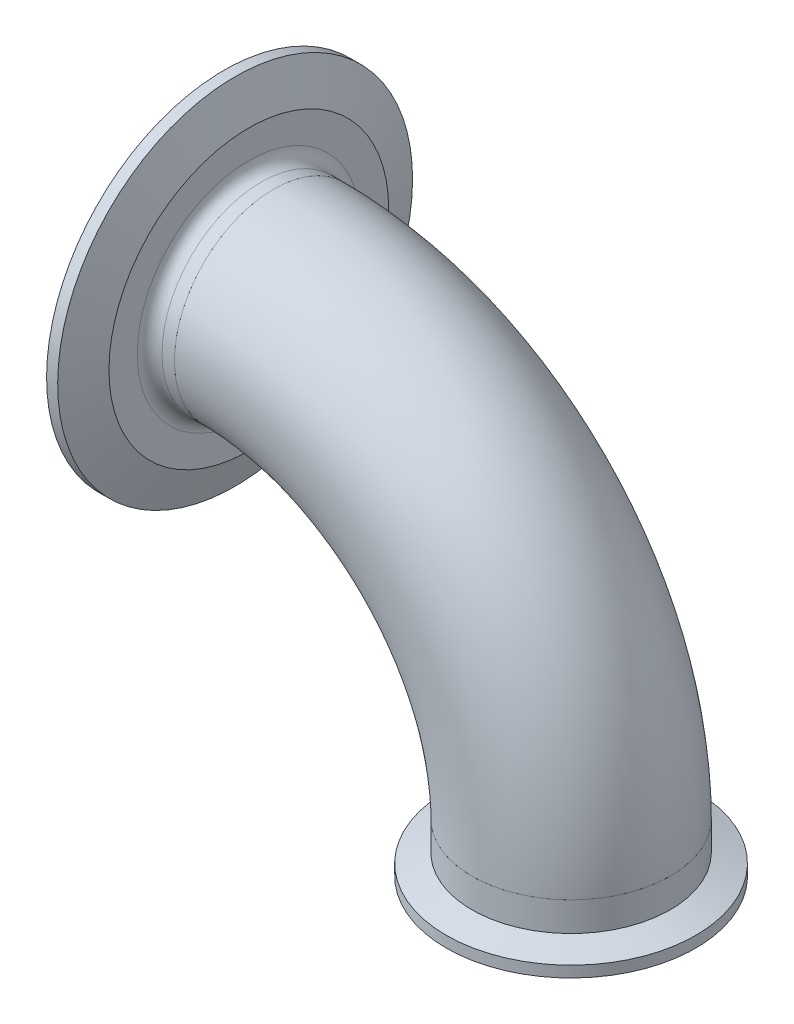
ISO-10303-21;
HEADER;
FILE_DESCRIPTION(('STEP AP214'),'2;1');
FILE_NAME('part.step','',(''),(''),'','','');
FILE_SCHEMA(('AUTOMOTIVE_DESIGN { 1 0 10303 214 1 1 1 1 }'));
ENDSEC;
DATA;
#1=APPLICATION_CONTEXT('core data for automotive mechanical design processes');
#2=APPLICATION_PROTOCOL_DEFINITION('international standard','automotive_design',2000,#1);
#3=PRODUCT_CONTEXT('',#1,'mechanical');
#4=PRODUCT('Part','Part','',(#3));
#5=PRODUCT_RELATED_PRODUCT_CATEGORY('part','',(#4));
#6=PRODUCT_DEFINITION_FORMATION('','',#4);
#7=PRODUCT_DEFINITION_CONTEXT('part definition',#1,'design');
#8=PRODUCT_DEFINITION('design','',#6,#7);
#9=PRODUCT_DEFINITION_SHAPE('','',#8);
#10=(LENGTH_UNIT() NAMED_UNIT(*) SI_UNIT(.MILLI.,.METRE.));
#11=(NAMED_UNIT(*) PLANE_ANGLE_UNIT() SI_UNIT($,.RADIAN.));
#12=(NAMED_UNIT(*) SI_UNIT($,.STERADIAN.) SOLID_ANGLE_UNIT());
#13=UNCERTAINTY_MEASURE_WITH_UNIT(LENGTH_MEASURE(1.E-05),#10,'distance_accuracy_value','');
#14=(GEOMETRIC_REPRESENTATION_CONTEXT(3) GLOBAL_UNCERTAINTY_ASSIGNED_CONTEXT((#13)) GLOBAL_UNIT_ASSIGNED_CONTEXT((#10,
#11,#12)) REPRESENTATION_CONTEXT('',''));
#15=CARTESIAN_POINT('',(0.,0.,0.));
#16=DIRECTION('',(0.,0.,1.));
#17=DIRECTION('',(1.,0.,0.));
#18=AXIS2_PLACEMENT_3D('',#15,#16,#17);
#19=CARTESIAN_POINT('',(9.0636819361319,123.185113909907,125.356807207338));
#20=DIRECTION('',(-1.,0.,0.));
#21=DIRECTION('',(0.,0.687039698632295,-0.726619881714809));
#22=AXIS2_PLACEMENT_3D('',#19,#20,#21);
#23=PLANE('',#22);
#24=CARTESIAN_POINT('',(9.06368193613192,105.928618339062,109.04030140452));
#25=DIRECTION('',(-1.,0.,0.));
#26=DIRECTION('',(0.,0.687039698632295,-0.726619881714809));
#27=AXIS2_PLACEMENT_3D('',#24,#25,#26);
#28=CIRCLE('',#27,25.4);
#29=CARTESIAN_POINT('',(9.06368193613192,123.379426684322,90.5841564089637));
#30=VERTEX_POINT('',#29);
#31=EDGE_CURVE('P0_E9',#30,#30,#28,.T.);
#32=ORIENTED_EDGE('',*,*,#31,.F.);
#33=EDGE_LOOP('',(#32));
#34=FACE_BOUND('',#33,.T.);
#35=CARTESIAN_POINT('',(9.06368193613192,105.928618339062,109.04030140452));
#36=DIRECTION('',(-1.,0.,0.));
#37=DIRECTION('',(0.,0.687039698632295,-0.726619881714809));
#38=AXIS2_PLACEMENT_3D('',#35,#36,#37);
#39=CIRCLE('',#38,23.749);
#40=CARTESIAN_POINT('',(9.06368193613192,122.24512414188,91.7838058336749));
#41=VERTEX_POINT('',#40);
#42=EDGE_CURVE('P0_E63',#41,#41,#39,.T.);
#43=ORIENTED_EDGE('',*,*,#42,.T.);
#44=EDGE_LOOP('',(#43));
#45=FACE_BOUND('',#44,.T.);
#46=ADVANCED_FACE('P0_F14',(#34,#45),#23,.F.);
#47=CARTESIAN_POINT('',(-3.63631806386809,105.928618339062,109.04030140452));
#48=DIRECTION('',(-1.,0.,0.));
#49=DIRECTION('',(0.,0.687039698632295,-0.726619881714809));
#50=AXIS2_PLACEMENT_3D('',#47,#48,#49);
#51=CYLINDRICAL_SURFACE('',#50,25.4);
#52=CARTESIAN_POINT('',(5.8886819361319,105.928618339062,109.04030140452));
#53=DIRECTION('',(-1.,0.,0.));
#54=DIRECTION('',(0.,0.687039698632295,-0.726619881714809));
#55=AXIS2_PLACEMENT_3D('',#52,#53,#54);
#56=CIRCLE('',#55,25.4);
#57=CARTESIAN_POINT('',(5.8886819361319,123.379426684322,90.5841564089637));
#58=VERTEX_POINT('',#57);
#59=EDGE_CURVE('P0_E20',#58,#58,#56,.T.);
#60=ORIENTED_EDGE('',*,*,#59,.F.);
#61=EDGE_LOOP('',(#60));
#62=FACE_BOUND('',#61,.T.);
#63=ORIENTED_EDGE('',*,*,#31,.T.);
#64=EDGE_LOOP('',(#63));
#65=FACE_BOUND('',#64,.T.);
#66=ADVANCED_FACE('P0_F142',(#62,#65),#51,.T.);
#67=CARTESIAN_POINT('',(5.8886819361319,105.928618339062,109.04030140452));
#68=DIRECTION('',(-1.,0.,0.));
#69=DIRECTION('',(0.,0.687039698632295,-0.726619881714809));
#70=AXIS2_PLACEMENT_3D('',#67,#68,#69);
#71=TOROIDAL_SURFACE('',#70,28.575,3.175);
#72=CARTESIAN_POINT('',(2.71368193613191,105.928618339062,109.04030140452));
#73=DIRECTION('',(-1.,0.,0.));
#74=DIRECTION('',(0.,0.687039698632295,-0.726619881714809));
#75=AXIS2_PLACEMENT_3D('',#72,#73,#74);
#76=CIRCLE('',#75,28.575);
#77=CARTESIAN_POINT('',(2.71368193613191,125.560777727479,88.2771382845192));
#78=VERTEX_POINT('',#77);
#79=EDGE_CURVE('P0_E24',#78,#78,#76,.T.);
#80=ORIENTED_EDGE('',*,*,#79,.F.);
#81=EDGE_LOOP('',(#80));
#82=FACE_BOUND('',#81,.T.);
#83=ORIENTED_EDGE('',*,*,#59,.T.);
#84=EDGE_LOOP('',(#83));
#85=FACE_BOUND('',#84,.T.);
#86=ADVANCED_FACE('P0_F137',(#82,#85),#71,.F.);
#87=CARTESIAN_POINT('',(2.71368193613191,126.691781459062,128.672460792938));
#88=DIRECTION('',(-1.,0.,0.));
#89=DIRECTION('',(0.,0.687039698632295,-0.726619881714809));
#90=AXIS2_PLACEMENT_3D('',#87,#88,#89);
#91=PLANE('',#90);
#92=CARTESIAN_POINT('',(2.71368193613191,105.928618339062,109.04030140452));
#93=DIRECTION('',(-1.,0.,0.));
#94=DIRECTION('',(0.,0.687039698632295,-0.726619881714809));
#95=AXIS2_PLACEMENT_3D('',#92,#93,#94);
#96=CIRCLE('',#95,35.8228421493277);
#97=CARTESIAN_POINT('',(2.71368193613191,130.540333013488,83.0107120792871));
#98=VERTEX_POINT('',#97);
#99=EDGE_CURVE('P0_E28',#98,#98,#96,.T.);
#100=ORIENTED_EDGE('',*,*,#99,.F.);
#101=EDGE_LOOP('',(#100));
#102=FACE_BOUND('',#101,.T.);
#103=ORIENTED_EDGE('',*,*,#79,.T.);
#104=EDGE_LOOP('',(#103));
#105=FACE_BOUND('',#104,.T.);
#106=ADVANCED_FACE('P0_F131',(#102,#105),#91,.F.);
#107=CARTESIAN_POINT('',(2.71368193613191,105.928618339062,109.04030140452));
#108=DIRECTION('',(-1.,0.,0.));
#109=DIRECTION('',(0.,0.687039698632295,-0.726619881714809));
#110=AXIS2_PLACEMENT_3D('',#107,#108,#109);
#111=CONICAL_SURFACE('',#110,35.8228421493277,1.22173047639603);
#112=CARTESIAN_POINT('',(-0.791518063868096,105.928618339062,109.04030140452));
#113=DIRECTION('',(-1.,0.,0.));
#114=DIRECTION('',(0.,0.687039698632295,-0.726619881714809));
#115=AXIS2_PLACEMENT_3D('',#112,#113,#114);
#116=CIRCLE('',#115,45.4533);
#117=CARTESIAN_POINT('',(-0.791518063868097,137.156839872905,76.0130299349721));
#118=VERTEX_POINT('',#117);
#119=EDGE_CURVE('P0_E33',#118,#118,#116,.T.);
#120=ORIENTED_EDGE('',*,*,#119,.F.);
#121=EDGE_LOOP('',(#120));
#122=FACE_BOUND('',#121,.T.);
#123=ORIENTED_EDGE('',*,*,#99,.T.);
#124=EDGE_LOOP('',(#123));
#125=FACE_BOUND('',#124,.T.);
#126=ADVANCED_FACE('P0_F125',(#122,#125),#111,.T.);
#127=CARTESIAN_POINT('',(-3.63631806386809,105.928618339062,109.04030140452));
#128=DIRECTION('',(-1.,0.,0.));
#129=DIRECTION('',(0.,0.687039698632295,-0.726619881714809));
#130=AXIS2_PLACEMENT_3D('',#127,#128,#129);
#131=CYLINDRICAL_SURFACE('',#130,45.4533);
#132=CARTESIAN_POINT('',(-3.63631806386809,105.928618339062,109.04030140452));
#133=DIRECTION('',(-1.,0.,0.));
#134=DIRECTION('',(0.,0.687039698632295,-0.726619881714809));
#135=AXIS2_PLACEMENT_3D('',#132,#133,#134);
#136=CIRCLE('',#135,45.4533);
#137=CARTESIAN_POINT('',(-3.63631806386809,137.156839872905,76.0130299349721));
#138=VERTEX_POINT('',#137);
#139=EDGE_CURVE('P0_E36',#138,#138,#136,.T.);
#140=ORIENTED_EDGE('',*,*,#139,.F.);
#141=EDGE_LOOP('',(#140));
#142=FACE_BOUND('',#141,.T.);
#143=ORIENTED_EDGE('',*,*,#119,.T.);
#144=EDGE_LOOP('',(#143));
#145=FACE_BOUND('',#144,.T.);
#146=ADVANCED_FACE('P0_F119',(#142,#145),#131,.T.);
#147=CARTESIAN_POINT('',(-3.63631806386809,105.928618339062,109.04030140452));
#148=DIRECTION('',(-1.,0.,0.));
#149=DIRECTION('',(0.,0.687039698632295,-0.726619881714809));
#150=AXIS2_PLACEMENT_3D('',#147,#148,#149);
#151=CONICAL_SURFACE('',#150,45.4533,1.56939586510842);
#152=CARTESIAN_POINT('',(-3.63380559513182,105.928618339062,109.04030140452));
#153=DIRECTION('',(-1.,0.,0.));
#154=DIRECTION('',(0.,0.687039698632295,-0.726619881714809));
#155=AXIS2_PLACEMENT_3D('',#152,#153,#154);
#156=CIRCLE('',#155,43.6592722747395);
#157=CARTESIAN_POINT('',(-3.63380559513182,135.924271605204,77.316606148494));
#158=VERTEX_POINT('',#157);
#159=EDGE_CURVE('P0_E39',#158,#158,#156,.T.);
#160=ORIENTED_EDGE('',*,*,#159,.F.);
#161=EDGE_LOOP('',(#160));
#162=FACE_BOUND('',#161,.T.);
#163=ORIENTED_EDGE('',*,*,#139,.T.);
#164=EDGE_LOOP('',(#163));
#165=FACE_BOUND('',#164,.T.);
#166=ADVANCED_FACE('P0_F113',(#162,#165),#151,.F.);
#167=CARTESIAN_POINT('',(-2.84640559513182,105.928618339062,109.04030140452));
#168=DIRECTION('',(-1.,0.,0.));
#169=DIRECTION('',(0.,0.687039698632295,-0.726619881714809));
#170=AXIS2_PLACEMENT_3D('',#167,#168,#169);
#171=TOROIDAL_SURFACE('',#170,43.6592722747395,0.787399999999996);
#172=CARTESIAN_POINT('',(-3.15406728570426,105.928618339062,109.04030140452));
#173=DIRECTION('',(-1.,0.,0.));
#174=DIRECTION('',(0.,0.687039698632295,-0.726619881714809));
#175=AXIS2_PLACEMENT_3D('',#172,#173,#174);
#176=CIRCLE('',#175,42.9344667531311);
#177=CARTESIAN_POINT('',(-3.15406728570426,135.426301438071,77.8432642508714));
#178=VERTEX_POINT('',#177);
#179=EDGE_CURVE('P0_E42',#178,#178,#176,.T.);
#180=ORIENTED_EDGE('',*,*,#179,.F.);
#181=EDGE_LOOP('',(#180));
#182=FACE_BOUND('',#181,.T.);
#183=ORIENTED_EDGE('',*,*,#159,.T.);
#184=EDGE_LOOP('',(#183));
#185=FACE_BOUND('',#184,.T.);
#186=ADVANCED_FACE('P0_F107',(#182,#185),#171,.T.);
#187=CARTESIAN_POINT('',(-3.15406728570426,105.928618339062,109.04030140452));
#188=DIRECTION('',(-1.,0.,0.));
#189=DIRECTION('',(0.,0.687039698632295,-0.726619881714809));
#190=AXIS2_PLACEMENT_3D('',#187,#188,#189);
#191=CONICAL_SURFACE('',#190,42.9344667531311,0.401425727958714);
#192=CARTESIAN_POINT('',(-2.76095077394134,105.928618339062,109.04030140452));
#193=DIRECTION('',(-1.,0.,0.));
#194=DIRECTION('',(0.,0.687039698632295,-0.726619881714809));
#195=AXIS2_PLACEMENT_3D('',#192,#193,#194);
#196=CIRCLE('',#195,42.7675986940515);
#197=CARTESIAN_POINT('',(-2.76095077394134,135.31165645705,77.9645139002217));
#198=VERTEX_POINT('',#197);
#199=EDGE_CURVE('P0_E45',#198,#198,#196,.T.);
#200=ORIENTED_EDGE('',*,*,#199,.F.);
#201=EDGE_LOOP('',(#200));
#202=FACE_BOUND('',#201,.T.);
#203=ORIENTED_EDGE('',*,*,#179,.T.);
#204=EDGE_LOOP('',(#203));
#205=FACE_BOUND('',#204,.T.);
#206=ADVANCED_FACE('P0_F101',(#202,#205),#191,.F.);
#207=CARTESIAN_POINT('',(-3.22740559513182,105.928618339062,109.04030140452));
#208=DIRECTION('',(-1.,0.,0.));
#209=DIRECTION('',(0.,0.687039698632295,-0.726619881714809));
#210=AXIS2_PLACEMENT_3D('',#207,#208,#209);
#211=TOROIDAL_SURFACE('',#210,41.6687,1.19379999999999);
#212=CARTESIAN_POINT('',(-2.76095077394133,105.928618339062,109.04030140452));
#213=DIRECTION('',(-1.,0.,0.));
#214=DIRECTION('',(0.,0.687039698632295,-0.726619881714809));
#215=AXIS2_PLACEMENT_3D('',#212,#213,#214);
#216=CIRCLE('',#215,40.5698013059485);
#217=CARTESIAN_POINT('',(-2.76095077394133,133.801682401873,79.5614771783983));
#218=VERTEX_POINT('',#217);
#219=EDGE_CURVE('P0_E48',#218,#218,#216,.T.);
#220=ORIENTED_EDGE('',*,*,#219,.F.);
#221=EDGE_LOOP('',(#220));
#222=FACE_BOUND('',#221,.T.);
#223=ORIENTED_EDGE('',*,*,#199,.T.);
#224=EDGE_LOOP('',(#223));
#225=FACE_BOUND('',#224,.T.);
#226=ADVANCED_FACE('P0_F95',(#222,#225),#211,.F.);
#227=CARTESIAN_POINT('',(-2.76095077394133,105.928618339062,109.04030140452));
#228=DIRECTION('',(1.,0.,0.));
#229=DIRECTION('',(0.,-0.687039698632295,0.726619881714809));
#230=AXIS2_PLACEMENT_3D('',#227,#228,#229);
#231=CONICAL_SURFACE('',#230,40.5698013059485,0.401425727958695);
#232=CARTESIAN_POINT('',(-3.15406728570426,105.928618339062,109.04030140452));
#233=DIRECTION('',(-1.,0.,0.));
#234=DIRECTION('',(0.,0.687039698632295,-0.726619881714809));
#235=AXIS2_PLACEMENT_3D('',#232,#233,#234);
#236=CIRCLE('',#235,40.402933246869);
#237=CARTESIAN_POINT('',(-3.15406728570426,133.687037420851,79.6827268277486));
#238=VERTEX_POINT('',#237);
#239=EDGE_CURVE('P0_E51',#238,#238,#236,.T.);
#240=ORIENTED_EDGE('',*,*,#239,.F.);
#241=EDGE_LOOP('',(#240));
#242=FACE_BOUND('',#241,.T.);
#243=ORIENTED_EDGE('',*,*,#219,.T.);
#244=EDGE_LOOP('',(#243));
#245=FACE_BOUND('',#244,.T.);
#246=ADVANCED_FACE('P0_F89',(#242,#245),#231,.T.);
#247=CARTESIAN_POINT('',(-2.84640559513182,105.928618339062,109.04030140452));
#248=DIRECTION('',(-1.,0.,0.));
#249=DIRECTION('',(0.,0.687039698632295,-0.726619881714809));
#250=AXIS2_PLACEMENT_3D('',#247,#248,#249);
#251=TOROIDAL_SURFACE('',#250,39.6781277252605,0.787399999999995);
#252=CARTESIAN_POINT('',(-3.63380559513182,105.928618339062,109.04030140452));
#253=DIRECTION('',(-1.,0.,0.));
#254=DIRECTION('',(0.,0.687039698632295,-0.726619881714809));
#255=AXIS2_PLACEMENT_3D('',#252,#253,#254);
#256=CIRCLE('',#255,39.6781277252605);
#257=CARTESIAN_POINT('',(-3.63380559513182,133.189067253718,80.209384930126));
#258=VERTEX_POINT('',#257);
#259=EDGE_CURVE('P0_E54',#258,#258,#256,.T.);
#260=ORIENTED_EDGE('',*,*,#259,.F.);
#261=EDGE_LOOP('',(#260));
#262=FACE_BOUND('',#261,.T.);
#263=ORIENTED_EDGE('',*,*,#239,.T.);
#264=EDGE_LOOP('',(#263));
#265=FACE_BOUND('',#264,.T.);
#266=ADVANCED_FACE('P0_F83',(#262,#265),#251,.T.);
#267=CARTESIAN_POINT('',(-3.63380559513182,105.928618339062,109.04030140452));
#268=DIRECTION('',(1.,0.,0.));
#269=DIRECTION('',(0.,-0.687039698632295,0.726619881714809));
#270=AXIS2_PLACEMENT_3D('',#267,#268,#269);
#271=CONICAL_SURFACE('',#270,39.6781277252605,1.57001826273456);
#272=CARTESIAN_POINT('',(-3.63631806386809,105.928618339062,109.04030140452));
#273=DIRECTION('',(-1.,0.,0.));
#274=DIRECTION('',(0.,0.687039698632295,-0.726619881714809));
#275=AXIS2_PLACEMENT_3D('',#272,#273,#274);
#276=CIRCLE('',#275,36.449);
#277=CARTESIAN_POINT('',(-3.63631806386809,130.97052831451,82.5557333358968));
#278=VERTEX_POINT('',#277);
#279=EDGE_CURVE('P0_E57',#278,#278,#276,.T.);
#280=ORIENTED_EDGE('',*,*,#279,.F.);
#281=EDGE_LOOP('',(#280));
#282=FACE_BOUND('',#281,.T.);
#283=ORIENTED_EDGE('',*,*,#259,.T.);
#284=EDGE_LOOP('',(#283));
#285=FACE_BOUND('',#284,.T.);
#286=ADVANCED_FACE('P0_F77',(#282,#285),#271,.T.);
#287=CARTESIAN_POINT('',(-3.63631806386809,105.928618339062,109.04030140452));
#288=DIRECTION('',(-1.,0.,0.));
#289=DIRECTION('',(0.,0.687039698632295,-0.726619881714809));
#290=AXIS2_PLACEMENT_3D('',#287,#288,#289);
#291=CONICAL_SURFACE('',#290,36.449,1.09205251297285);
#292=CARTESIAN_POINT('',(2.95517535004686,105.928618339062,109.04030140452));
#293=DIRECTION('',(-1.,0.,0.));
#294=DIRECTION('',(0.,0.687039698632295,-0.726619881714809));
#295=AXIS2_PLACEMENT_3D('',#292,#293,#294);
#296=CIRCLE('',#295,23.749);
#297=CARTESIAN_POINT('',(2.95517535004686,122.24512414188,91.7838058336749));
#298=VERTEX_POINT('',#297);
#299=EDGE_CURVE('P0_E60',#298,#298,#296,.T.);
#300=ORIENTED_EDGE('',*,*,#299,.F.);
#301=EDGE_LOOP('',(#300));
#302=FACE_BOUND('',#301,.T.);
#303=ORIENTED_EDGE('',*,*,#279,.T.);
#304=EDGE_LOOP('',(#303));
#305=FACE_BOUND('',#304,.T.);
#306=ADVANCED_FACE('P0_F71',(#302,#305),#291,.F.);
#307=CARTESIAN_POINT('',(-3.63631806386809,105.928618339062,109.04030140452));
#308=DIRECTION('',(-1.,0.,0.));
#309=DIRECTION('',(0.,0.687039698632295,-0.726619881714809));
#310=AXIS2_PLACEMENT_3D('',#307,#308,#309);
#311=CYLINDRICAL_SURFACE('',#310,23.749);
#312=ORIENTED_EDGE('',*,*,#42,.F.);
#313=EDGE_LOOP('',(#312));
#314=FACE_BOUND('',#313,.T.);
#315=ORIENTED_EDGE('',*,*,#299,.T.);
#316=EDGE_LOOP('',(#315));
#317=FACE_BOUND('',#316,.T.);
#318=ADVANCED_FACE('P0_F68',(#314,#317),#311,.F.);
#319=CLOSED_SHELL('',(#46,#66,#86,#106,#126,#146,#166,#186,#206,#226,#246,#266,#286,#306,#318));
#320=MANIFOLD_SOLID_BREP('P0_B1',#319);
#321=CARTESIAN_POINT('',(85.2636819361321,17.0286183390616,109.04030140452));
#322=DIRECTION('',(0.,1.,0.));
#323=DIRECTION('',(0.,0.,1.));
#324=AXIS2_PLACEMENT_3D('',#321,#322,#323);
#325=PLANE('',#324);
#326=CARTESIAN_POINT('',(85.2636819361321,17.0286183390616,109.04030140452));
#327=DIRECTION('',(0.,-1.,0.));
#328=DIRECTION('',(0.,0.,-1.));
#329=AXIS2_PLACEMENT_3D('',#326,#327,#328);
#330=CIRCLE('',#329,30.1591722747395);
#331=CARTESIAN_POINT('',(85.263681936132,17.0286183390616,78.8811291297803));
#332=VERTEX_POINT('',#331);
#333=EDGE_CURVE('P1_E10',#332,#332,#330,.T.);
#334=ORIENTED_EDGE('',*,*,#333,.F.);
#335=EDGE_LOOP('',(#334));
#336=FACE_BOUND('',#335,.T.);
#337=CARTESIAN_POINT('',(85.2636819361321,17.0286183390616,109.04030140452));
#338=DIRECTION('',(0.,-1.,0.));
#339=DIRECTION('',(0.,0.,-1.));
#340=AXIS2_PLACEMENT_3D('',#337,#338,#339);
#341=CIRCLE('',#340,31.9532);
#342=CARTESIAN_POINT('',(85.263681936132,17.0286183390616,77.0871014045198));
#343=VERTEX_POINT('',#342);
#344=EDGE_CURVE('P1_E55',#343,#343,#341,.T.);
#345=ORIENTED_EDGE('',*,*,#344,.T.);
#346=EDGE_LOOP('',(#345));
#347=FACE_BOUND('',#346,.T.);
#348=ADVANCED_FACE('P1_F15',(#336,#347),#325,.F.);
#349=CARTESIAN_POINT('',(85.2636819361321,17.8160183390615,109.04030140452));
#350=DIRECTION('',(0.,-1.,0.));
#351=DIRECTION('',(0.,0.,-1.));
#352=AXIS2_PLACEMENT_3D('',#349,#350,#351);
#353=TOROIDAL_SURFACE('',#352,30.1591722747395,0.7874);
#354=CARTESIAN_POINT('',(85.2636819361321,17.5083566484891,109.04030140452));
#355=DIRECTION('',(0.,-1.,0.));
#356=DIRECTION('',(0.,0.,-1.));
#357=AXIS2_PLACEMENT_3D('',#354,#355,#356);
#358=CIRCLE('',#357,29.4343667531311);
#359=CARTESIAN_POINT('',(85.263681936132,17.5083566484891,79.6059346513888));
#360=VERTEX_POINT('',#359);
#361=EDGE_CURVE('P1_E21',#360,#360,#358,.T.);
#362=ORIENTED_EDGE('',*,*,#361,.F.);
#363=EDGE_LOOP('',(#362));
#364=FACE_BOUND('',#363,.T.);
#365=ORIENTED_EDGE('',*,*,#333,.T.);
#366=EDGE_LOOP('',(#365));
#367=FACE_BOUND('',#366,.T.);
#368=ADVANCED_FACE('P1_F97',(#364,#367),#353,.T.);
#369=CARTESIAN_POINT('',(85.2636819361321,17.901473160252,109.04030140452));
#370=DIRECTION('',(0.,-1.,0.));
#371=DIRECTION('',(0.,0.,-1.));
#372=AXIS2_PLACEMENT_3D('',#369,#370,#371);
#373=CONICAL_SURFACE('',#372,29.2674986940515,0.401425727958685);
#374=ORIENTED_EDGE('',*,*,#361,.T.);
#375=EDGE_LOOP('',(#374));
#376=FACE_BOUND('',#375,.T.);
#377=CARTESIAN_POINT('',(85.2636819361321,17.901473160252,109.04030140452));
#378=DIRECTION('',(0.,-1.,0.));
#379=DIRECTION('',(0.,0.,-1.));
#380=AXIS2_PLACEMENT_3D('',#377,#378,#379);
#381=CIRCLE('',#380,29.2674986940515);
#382=CARTESIAN_POINT('',(85.263681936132,17.901473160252,79.7728027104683));
#383=VERTEX_POINT('',#382);
#384=EDGE_CURVE('P1_E25',#383,#383,#381,.T.);
#385=ORIENTED_EDGE('',*,*,#384,.F.);
#386=EDGE_LOOP('',(#385));
#387=FACE_BOUND('',#386,.T.);
#388=ADVANCED_FACE('P1_F102',(#376,#387),#373,.F.);
#389=CARTESIAN_POINT('',(85.2636819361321,17.4350183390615,109.04030140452));
#390=DIRECTION('',(0.,-1.,0.));
#391=DIRECTION('',(0.,0.,-1.));
#392=AXIS2_PLACEMENT_3D('',#389,#390,#391);
#393=TOROIDAL_SURFACE('',#392,28.1686,1.1938);
#394=CARTESIAN_POINT('',(85.2636819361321,17.9014731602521,109.04030140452));
#395=DIRECTION('',(0.,-1.,0.));
#396=DIRECTION('',(0.,0.,-1.));
#397=AXIS2_PLACEMENT_3D('',#394,#395,#396);
#398=CIRCLE('',#397,27.0697013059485);
#399=CARTESIAN_POINT('',(85.263681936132,17.9014731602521,81.9706000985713));
#400=VERTEX_POINT('',#399);
#401=EDGE_CURVE('P1_E29',#400,#400,#398,.T.);
#402=ORIENTED_EDGE('',*,*,#401,.F.);
#403=EDGE_LOOP('',(#402));
#404=FACE_BOUND('',#403,.T.);
#405=ORIENTED_EDGE('',*,*,#384,.T.);
#406=EDGE_LOOP('',(#405));
#407=FACE_BOUND('',#406,.T.);
#408=ADVANCED_FACE('P1_F107',(#404,#407),#393,.F.);
#409=CARTESIAN_POINT('',(85.2636819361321,17.9014731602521,109.04030140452));
#410=DIRECTION('',(0.,1.,0.));
#411=DIRECTION('',(0.,0.,1.));
#412=AXIS2_PLACEMENT_3D('',#409,#410,#411);
#413=CONICAL_SURFACE('',#412,27.0697013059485,0.401425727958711);
#414=CARTESIAN_POINT('',(85.2636819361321,17.5083566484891,109.04030140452));
#415=DIRECTION('',(0.,-1.,0.));
#416=DIRECTION('',(0.,0.,-1.));
#417=AXIS2_PLACEMENT_3D('',#414,#415,#416);
#418=CIRCLE('',#417,26.9028332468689);
#419=CARTESIAN_POINT('',(85.263681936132,17.5083566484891,82.1374681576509));
#420=VERTEX_POINT('',#419);
#421=EDGE_CURVE('P1_E34',#420,#420,#418,.T.);
#422=ORIENTED_EDGE('',*,*,#421,.F.);
#423=EDGE_LOOP('',(#422));
#424=FACE_BOUND('',#423,.T.);
#425=ORIENTED_EDGE('',*,*,#401,.T.);
#426=EDGE_LOOP('',(#425));
#427=FACE_BOUND('',#426,.T.);
#428=ADVANCED_FACE('P1_F112',(#424,#427),#413,.T.);
#429=CARTESIAN_POINT('',(85.2636819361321,17.8160183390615,109.04030140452));
#430=DIRECTION('',(0.,-1.,0.));
#431=DIRECTION('',(0.,0.,-1.));
#432=AXIS2_PLACEMENT_3D('',#429,#430,#431);
#433=TOROIDAL_SURFACE('',#432,26.1780277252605,0.787399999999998);
#434=ORIENTED_EDGE('',*,*,#421,.T.);
#435=EDGE_LOOP('',(#434));
#436=FACE_BOUND('',#435,.T.);
#437=CARTESIAN_POINT('',(85.2636819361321,17.0286183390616,109.04030140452));
#438=DIRECTION('',(0.,-1.,0.));
#439=DIRECTION('',(0.,0.,-1.));
#440=AXIS2_PLACEMENT_3D('',#437,#438,#439);
#441=CIRCLE('',#440,26.1780277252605);
#442=CARTESIAN_POINT('',(85.263681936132,17.0286183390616,82.8622736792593));
#443=VERTEX_POINT('',#442);
#444=EDGE_CURVE('P1_E37',#443,#443,#441,.T.);
#445=ORIENTED_EDGE('',*,*,#444,.F.);
#446=EDGE_LOOP('',(#445));
#447=FACE_BOUND('',#446,.T.);
#448=ADVANCED_FACE('P1_F93',(#436,#447),#433,.T.);
#449=CARTESIAN_POINT('',(85.2636819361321,17.0286183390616,109.04030140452));
#450=DIRECTION('',(0.,1.,0.));
#451=DIRECTION('',(0.,0.,1.));
#452=AXIS2_PLACEMENT_3D('',#449,#450,#451);
#453=PLANE('',#452);
#454=CARTESIAN_POINT('',(85.2636819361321,17.0286183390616,109.04030140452));
#455=DIRECTION('',(0.,-1.,0.));
#456=DIRECTION('',(0.,0.,-1.));
#457=AXIS2_PLACEMENT_3D('',#454,#455,#456);
#458=CIRCLE('',#457,23.749);
#459=CARTESIAN_POINT('',(85.263681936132,17.0286183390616,85.2913014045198));
#460=VERTEX_POINT('',#459);
#461=EDGE_CURVE('P1_E40',#460,#460,#458,.T.);
#462=ORIENTED_EDGE('',*,*,#461,.F.);
#463=EDGE_LOOP('',(#462));
#464=FACE_BOUND('',#463,.T.);
#465=ORIENTED_EDGE('',*,*,#444,.T.);
#466=EDGE_LOOP('',(#465));
#467=FACE_BOUND('',#466,.T.);
#468=ADVANCED_FACE('P1_F86',(#464,#467),#453,.F.);
#469=CARTESIAN_POINT('',(85.2636819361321,17.0286183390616,109.04030140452));
#470=DIRECTION('',(0.,-1.,0.));
#471=DIRECTION('',(0.,0.,-1.));
#472=AXIS2_PLACEMENT_3D('',#469,#470,#471);
#473=CYLINDRICAL_SURFACE('',#472,23.749);
#474=ORIENTED_EDGE('',*,*,#461,.T.);
#475=EDGE_LOOP('',(#474));
#476=FACE_BOUND('',#475,.T.);
#477=CARTESIAN_POINT('',(85.2636819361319,29.7286183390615,109.04030140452));
#478=DIRECTION('',(0.,-1.,0.));
#479=DIRECTION('',(0.,0.,-1.));
#480=AXIS2_PLACEMENT_3D('',#477,#478,#479);
#481=CIRCLE('',#480,23.749);
#482=CARTESIAN_POINT('',(85.2636819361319,29.7286183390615,85.2913014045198));
#483=VERTEX_POINT('',#482);
#484=EDGE_CURVE('P1_E43',#483,#483,#481,.T.);
#485=ORIENTED_EDGE('',*,*,#484,.F.);
#486=EDGE_LOOP('',(#485));
#487=FACE_BOUND('',#486,.T.);
#488=ADVANCED_FACE('P1_F81',(#476,#487),#473,.F.);
#489=CARTESIAN_POINT('',(85.2636819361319,29.7286183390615,109.04030140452));
#490=DIRECTION('',(0.,-1.,0.));
#491=DIRECTION('',(0.,0.,-1.));
#492=AXIS2_PLACEMENT_3D('',#489,#490,#491);
#493=PLANE('',#492);
#494=CARTESIAN_POINT('',(85.2636819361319,29.7286183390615,109.04030140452));
#495=DIRECTION('',(0.,-1.,0.));
#496=DIRECTION('',(0.,0.,-1.));
#497=AXIS2_PLACEMENT_3D('',#494,#495,#496);
#498=CIRCLE('',#497,25.4);
#499=CARTESIAN_POINT('',(85.2636819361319,29.7286183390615,83.6403014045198));
#500=VERTEX_POINT('',#499);
#501=EDGE_CURVE('P1_E46',#500,#500,#498,.T.);
#502=ORIENTED_EDGE('',*,*,#501,.F.);
#503=EDGE_LOOP('',(#502));
#504=FACE_BOUND('',#503,.T.);
#505=ORIENTED_EDGE('',*,*,#484,.T.);
#506=EDGE_LOOP('',(#505));
#507=FACE_BOUND('',#506,.T.);
#508=ADVANCED_FACE('P1_F75',(#504,#507),#493,.F.);
#509=CARTESIAN_POINT('',(85.2636819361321,17.0286183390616,109.04030140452));
#510=DIRECTION('',(0.,-1.,0.));
#511=DIRECTION('',(0.,0.,-1.));
#512=AXIS2_PLACEMENT_3D('',#509,#510,#511);
#513=CYLINDRICAL_SURFACE('',#512,25.4);
#514=CARTESIAN_POINT('',(85.2636819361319,22.2585880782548,109.04030140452));
#515=DIRECTION('',(0.,-1.,0.));
#516=DIRECTION('',(0.,0.,-1.));
#517=AXIS2_PLACEMENT_3D('',#514,#515,#516);
#518=CIRCLE('',#517,25.4);
#519=CARTESIAN_POINT('',(85.2636819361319,22.2585880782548,83.6403014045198));
#520=VERTEX_POINT('',#519);
#521=EDGE_CURVE('P1_E49',#520,#520,#518,.T.);
#522=ORIENTED_EDGE('',*,*,#521,.F.);
#523=EDGE_LOOP('',(#522));
#524=FACE_BOUND('',#523,.T.);
#525=ORIENTED_EDGE('',*,*,#501,.T.);
#526=EDGE_LOOP('',(#525));
#527=FACE_BOUND('',#526,.T.);
#528=ADVANCED_FACE('P1_F69',(#524,#527),#513,.T.);
#529=CARTESIAN_POINT('',(85.2636819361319,22.2585880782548,109.04030140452));
#530=DIRECTION('',(0.,-1.,0.));
#531=DIRECTION('',(0.,0.,-1.));
#532=AXIS2_PLACEMENT_3D('',#529,#530,#531);
#533=CONICAL_SURFACE('',#532,25.4,1.22173047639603);
#534=CARTESIAN_POINT('',(85.2636819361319,19.8734183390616,109.04030140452));
#535=DIRECTION('',(0.,-1.,0.));
#536=DIRECTION('',(0.,0.,-1.));
#537=AXIS2_PLACEMENT_3D('',#534,#535,#536);
#538=CIRCLE('',#537,31.9532);
#539=CARTESIAN_POINT('',(85.2636819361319,19.8734183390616,77.0871014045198));
#540=VERTEX_POINT('',#539);
#541=EDGE_CURVE('P1_E52',#540,#540,#538,.T.);
#542=ORIENTED_EDGE('',*,*,#541,.F.);
#543=EDGE_LOOP('',(#542));
#544=FACE_BOUND('',#543,.T.);
#545=ORIENTED_EDGE('',*,*,#521,.T.);
#546=EDGE_LOOP('',(#545));
#547=FACE_BOUND('',#546,.T.);
#548=ADVANCED_FACE('P1_F63',(#544,#547),#533,.T.);
#549=CARTESIAN_POINT('',(85.2636819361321,17.0286183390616,109.04030140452));
#550=DIRECTION('',(0.,-1.,0.));
#551=DIRECTION('',(0.,0.,-1.));
#552=AXIS2_PLACEMENT_3D('',#549,#550,#551);
#553=CYLINDRICAL_SURFACE('',#552,31.9532);
#554=ORIENTED_EDGE('',*,*,#344,.F.);
#555=EDGE_LOOP('',(#554));
#556=FACE_BOUND('',#555,.T.);
#557=ORIENTED_EDGE('',*,*,#541,.T.);
#558=EDGE_LOOP('',(#557));
#559=FACE_BOUND('',#558,.T.);
#560=ADVANCED_FACE('P1_F60',(#556,#559),#553,.T.);
#561=CLOSED_SHELL('',(#348,#368,#388,#408,#428,#448,#468,#488,#508,#528,#548,#560));
#562=MANIFOLD_SOLID_BREP('P1_B1',#561);
#563=CARTESIAN_POINT('',(9.06368193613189,29.7286183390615,109.04030140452));
#564=DIRECTION('',(0.,0.,-1.));
#565=DIRECTION('',(-1.,0.,0.));
#566=AXIS2_PLACEMENT_3D('',#563,#564,#565);
#567=TOROIDAL_SURFACE('',#566,76.2,25.4);
#568=CARTESIAN_POINT('',(9.0636819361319,105.928618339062,109.04030140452));
#569=DIRECTION('',(-1.,0.,0.));
#570=DIRECTION('',(0.,0.,1.));
#571=AXIS2_PLACEMENT_3D('',#568,#569,#570);
#572=CIRCLE('',#571,25.4);
#573=CARTESIAN_POINT('',(9.0636819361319,131.328618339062,109.04030140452));
#574=VERTEX_POINT('',#573);
#575=EDGE_CURVE('P2_E10',#574,#574,#572,.T.);
#576=CARTESIAN_POINT('',(85.2636819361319,29.7286183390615,109.04030140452));
#577=DIRECTION('',(0.,1.,0.));
#578=DIRECTION('',(0.,0.,1.));
#579=AXIS2_PLACEMENT_3D('',#576,#577,#578);
#580=CIRCLE('',#579,25.4);
#581=CARTESIAN_POINT('',(110.663681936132,29.7286183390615,109.04030140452));
#582=VERTEX_POINT('',#581);
#583=EDGE_CURVE('P2_E21',#582,#582,#580,.T.);
#584=CARTESIAN_POINT('',(9.06368193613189,29.7286183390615,109.04030140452));
#585=DIRECTION('',(0.,0.,-1.));
#586=DIRECTION('',(-1.,0.,0.));
#587=AXIS2_PLACEMENT_3D('',#584,#585,#586);
#588=CIRCLE('',#587,101.6);
#589=EDGE_CURVE('',#574,#582,#588,.T.);
#590=ORIENTED_EDGE('',*,*,#575,.F.);
#591=ORIENTED_EDGE('',*,*,#583,.T.);
#592=ORIENTED_EDGE('',*,*,#589,.T.);
#593=ORIENTED_EDGE('',*,*,#589,.F.);
#594=EDGE_LOOP('',(#590,#592,#591,#593));
#595=FACE_BOUND('',#594,.T.);
#596=ADVANCED_FACE('P2_F15',(#595),#567,.T.);
#597=CARTESIAN_POINT('',(9.0636819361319,105.928618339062,109.04030140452));
#598=DIRECTION('',(-1.,0.,0.));
#599=DIRECTION('',(0.,0.,1.));
#600=AXIS2_PLACEMENT_3D('',#597,#598,#599);
#601=PLANE('',#600);
#602=CARTESIAN_POINT('',(9.0636819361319,105.928618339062,109.04030140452));
#603=DIRECTION('',(-1.,0.,0.));
#604=DIRECTION('',(0.,-1.,0.));
#605=AXIS2_PLACEMENT_3D('',#602,#603,#604);
#606=CIRCLE('',#605,23.749);
#607=CARTESIAN_POINT('',(9.0636819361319,129.677618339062,109.04030140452));
#608=VERTEX_POINT('',#607);
#609=EDGE_CURVE('P2_E25',#608,#608,#606,.T.);
#610=ORIENTED_EDGE('',*,*,#609,.F.);
#611=EDGE_LOOP('',(#610));
#612=FACE_BOUND('',#611,.T.);
#613=ORIENTED_EDGE('',*,*,#575,.T.);
#614=EDGE_LOOP('',(#613));
#615=FACE_BOUND('',#614,.T.);
#616=ADVANCED_FACE('P2_F46',(#612,#615),#601,.T.);
#617=CARTESIAN_POINT('',(85.2636819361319,29.7286183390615,109.04030140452));
#618=DIRECTION('',(0.,1.,0.));
#619=DIRECTION('',(0.,0.,1.));
#620=AXIS2_PLACEMENT_3D('',#617,#618,#619);
#621=PLANE('',#620);
#622=CARTESIAN_POINT('',(85.2636819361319,29.7286183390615,109.04030140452));
#623=DIRECTION('',(0.,1.,0.));
#624=DIRECTION('',(0.,0.,1.));
#625=AXIS2_PLACEMENT_3D('',#622,#623,#624);
#626=CIRCLE('',#625,23.749);
#627=CARTESIAN_POINT('',(109.012681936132,29.7286183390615,109.04030140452));
#628=VERTEX_POINT('',#627);
#629=EDGE_CURVE('P2_E29',#628,#628,#626,.T.);
#630=ORIENTED_EDGE('',*,*,#629,.T.);
#631=EDGE_LOOP('',(#630));
#632=FACE_BOUND('',#631,.T.);
#633=ORIENTED_EDGE('',*,*,#583,.F.);
#634=EDGE_LOOP('',(#633));
#635=FACE_BOUND('',#634,.T.);
#636=ADVANCED_FACE('P2_F35',(#632,#635),#621,.F.);
#637=CARTESIAN_POINT('',(9.06368193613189,29.7286183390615,109.04030140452));
#638=DIRECTION('',(0.,0.,-1.));
#639=DIRECTION('',(-1.,0.,0.));
#640=AXIS2_PLACEMENT_3D('',#637,#638,#639);
#641=TOROIDAL_SURFACE('',#640,76.2,23.749);
#642=CARTESIAN_POINT('',(9.06368193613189,29.7286183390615,109.04030140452));
#643=DIRECTION('',(0.,0.,-1.));
#644=DIRECTION('',(-1.,0.,0.));
#645=AXIS2_PLACEMENT_3D('',#642,#643,#644);
#646=CIRCLE('',#645,99.949);
#647=EDGE_CURVE('',#608,#628,#646,.T.);
#648=ORIENTED_EDGE('',*,*,#609,.T.);
#649=ORIENTED_EDGE('',*,*,#629,.F.);
#650=ORIENTED_EDGE('',*,*,#647,.T.);
#651=ORIENTED_EDGE('',*,*,#647,.F.);
#652=EDGE_LOOP('',(#648,#650,#649,#651));
#653=FACE_BOUND('',#652,.T.);
#654=ADVANCED_FACE('P2_F38',(#653),#641,.F.);
#655=CLOSED_SHELL('',(#596,#616,#636,#654));
#656=MANIFOLD_SOLID_BREP('P2_B1',#655);
#657=ADVANCED_BREP_SHAPE_REPRESENTATION('',(#18,#320,#562,#656),#14);
#658=SHAPE_DEFINITION_REPRESENTATION(#9,#657);
ENDSEC;
END-ISO-10303-21;
